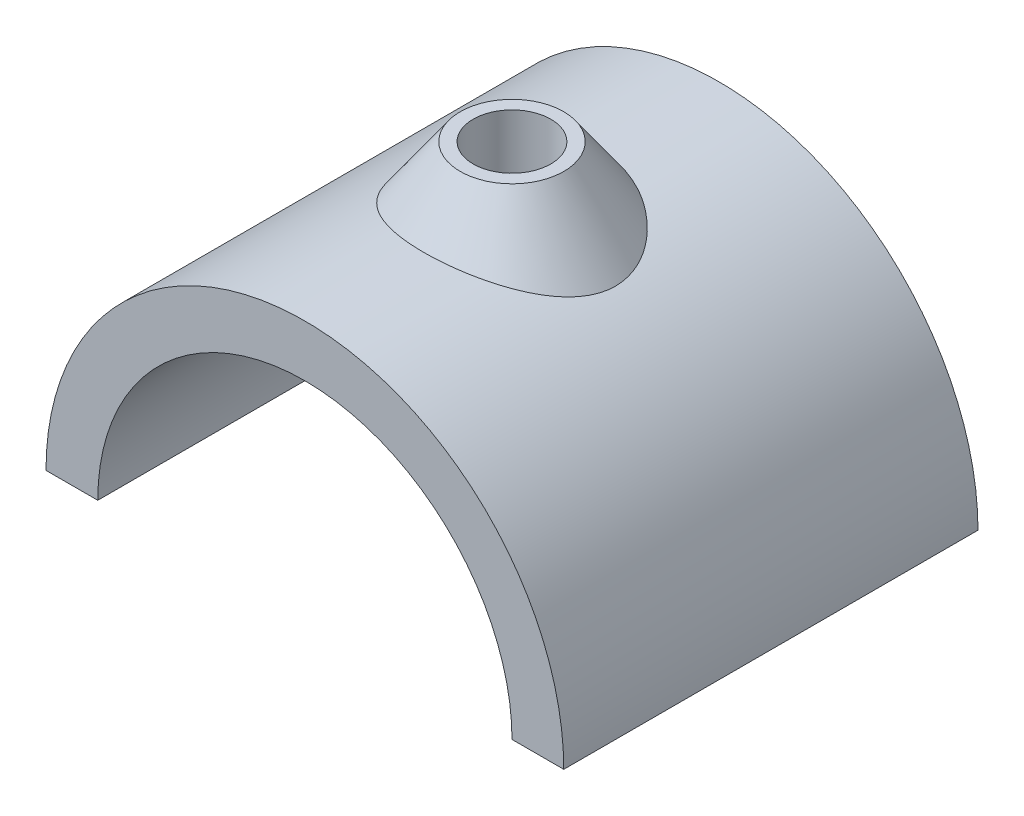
ISO-10303-21;
HEADER;
FILE_DESCRIPTION(('STEP AP214'),'2;1');
FILE_NAME('part.step','',(''),(''),'','','');
FILE_SCHEMA(('AUTOMOTIVE_DESIGN { 1 0 10303 214 1 1 1 1 }'));
ENDSEC;
DATA;
#1=APPLICATION_CONTEXT('core data for automotive mechanical design processes');
#2=APPLICATION_PROTOCOL_DEFINITION('international standard','automotive_design',2000,#1);
#3=PRODUCT_CONTEXT('',#1,'mechanical');
#4=PRODUCT('Part','Part','',(#3));
#5=PRODUCT_RELATED_PRODUCT_CATEGORY('part','',(#4));
#6=PRODUCT_DEFINITION_FORMATION('','',#4);
#7=PRODUCT_DEFINITION_CONTEXT('part definition',#1,'design');
#8=PRODUCT_DEFINITION('design','',#6,#7);
#9=PRODUCT_DEFINITION_SHAPE('','',#8);
#10=(LENGTH_UNIT() NAMED_UNIT(*) SI_UNIT(.MILLI.,.METRE.));
#11=(NAMED_UNIT(*) PLANE_ANGLE_UNIT() SI_UNIT($,.RADIAN.));
#12=(NAMED_UNIT(*) SI_UNIT($,.STERADIAN.) SOLID_ANGLE_UNIT());
#13=UNCERTAINTY_MEASURE_WITH_UNIT(LENGTH_MEASURE(1.E-05),#10,'distance_accuracy_value','');
#14=(GEOMETRIC_REPRESENTATION_CONTEXT(3) GLOBAL_UNCERTAINTY_ASSIGNED_CONTEXT((#13)) GLOBAL_UNIT_ASSIGNED_CONTEXT((#10,
#11,#12)) REPRESENTATION_CONTEXT('',''));
#15=CARTESIAN_POINT('',(0.,0.,0.));
#16=DIRECTION('',(0.,0.,1.));
#17=DIRECTION('',(1.,0.,0.));
#18=AXIS2_PLACEMENT_3D('',#15,#16,#17);
#19=CARTESIAN_POINT('',(0.,0.,40.));
#20=DIRECTION('',(0.,0.,-1.));
#21=DIRECTION('',(-1.,0.,0.));
#22=AXIS2_PLACEMENT_3D('',#19,#20,#21);
#23=CYLINDRICAL_SURFACE('',#22,50.);
#24=CARTESIAN_POINT('',(0.,0.,-40.));
#25=DIRECTION('',(0.,0.,1.));
#26=DIRECTION('',(-1.,0.,0.));
#27=AXIS2_PLACEMENT_3D('',#24,#25,#26);
#28=CIRCLE('',#27,50.);
#29=CARTESIAN_POINT('',(50.,0.,-40.));
#30=VERTEX_POINT('',#29);
#31=CARTESIAN_POINT('',(-50.,0.,-40.));
#32=VERTEX_POINT('',#31);
#33=EDGE_CURVE('E101',#30,#32,#28,.T.);
#34=ORIENTED_EDGE('',*,*,#33,.T.);
#35=DIRECTION('',(0.,0.,-1.));
#36=VECTOR('',#35,1.);
#37=CARTESIAN_POINT('',(-50.,0.,40.));
#38=LINE('',#37,#36);
#39=CARTESIAN_POINT('',(-50.,0.,40.));
#40=VERTEX_POINT('',#39);
#41=EDGE_CURVE('E43',#40,#32,#38,.T.);
#42=ORIENTED_EDGE('',*,*,#41,.F.);
#43=CARTESIAN_POINT('',(0.,0.,40.));
#44=DIRECTION('',(0.,0.,1.));
#45=DIRECTION('',(-1.,0.,0.));
#46=AXIS2_PLACEMENT_3D('',#43,#44,#45);
#47=CIRCLE('',#46,50.);
#48=CARTESIAN_POINT('',(50.,0.,40.));
#49=VERTEX_POINT('',#48);
#50=EDGE_CURVE('E87',#49,#40,#47,.T.);
#51=ORIENTED_EDGE('',*,*,#50,.F.);
#52=DIRECTION('',(0.,0.,-1.));
#53=VECTOR('',#52,1.);
#54=CARTESIAN_POINT('',(50.,0.,40.));
#55=LINE('',#54,#53);
#56=EDGE_CURVE('E97',#49,#30,#55,.T.);
#57=ORIENTED_EDGE('',*,*,#56,.T.);
#58=EDGE_LOOP('',(#34,#42,#51,#57));
#59=FACE_BOUND('',#58,.T.);
#60=CARTESIAN_POINT('',(-13.3891413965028,48.1739648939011,-12.5382835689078));
#61=CARTESIAN_POINT('',(-13.7678496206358,48.0687121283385,-12.2425151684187));
#62=CARTESIAN_POINT('',(-14.1355399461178,47.9616998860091,-11.9333646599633));
#63=CARTESIAN_POINT('',(-14.8468065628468,47.7463122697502,-11.2886841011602));
#64=CARTESIAN_POINT('',(-15.1903786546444,47.6379366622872,-10.9531494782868));
#65=CARTESIAN_POINT('',(-15.8509248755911,47.4222415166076,-10.2561478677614));
#66=CARTESIAN_POINT('',(-16.1678850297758,47.3149225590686,-9.89466743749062));
#67=CARTESIAN_POINT('',(-16.7720702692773,47.1041398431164,-9.14660673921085));
#68=CARTESIAN_POINT('',(-17.0593004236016,47.0006754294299,-8.76003076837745));
#69=CARTESIAN_POINT('',(-17.5616027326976,46.8150736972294,-8.020280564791));
#70=CARTESIAN_POINT('',(-17.7811052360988,46.7320142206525,-7.6703446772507));
#71=CARTESIAN_POINT('',(-18.1935552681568,46.5729899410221,-6.95364153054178));
#72=CARTESIAN_POINT('',(-18.3865080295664,46.497023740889,-6.58687760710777));
#73=CARTESIAN_POINT('',(-18.7432827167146,46.3543555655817,-5.83786916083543));
#74=CARTESIAN_POINT('',(-18.9071182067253,46.2876492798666,-5.45563194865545));
#75=CARTESIAN_POINT('',(-19.2030720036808,46.1656546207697,-4.67748355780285));
#76=CARTESIAN_POINT('',(-19.3352073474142,46.1103601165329,-4.28157985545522));
#77=CARTESIAN_POINT('',(-19.5664669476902,46.0127083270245,-3.47443087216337));
#78=CARTESIAN_POINT('',(-19.6652603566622,45.9704810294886,-3.06307441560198));
#79=CARTESIAN_POINT('',(-19.8258361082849,45.9014586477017,-2.23188204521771));
#80=CARTESIAN_POINT('',(-19.8876188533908,45.8746633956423,-1.81204622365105));
#81=CARTESIAN_POINT('',(-19.9725953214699,45.8377312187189,-0.968068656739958));
#82=CARTESIAN_POINT('',(-19.9958190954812,45.8275813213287,-0.543930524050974));
#83=CARTESIAN_POINT('',(-20.0031474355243,45.8243836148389,0.304723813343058));
#84=CARTESIAN_POINT('',(-19.9872564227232,45.8313338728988,0.729239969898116));
#85=CARTESIAN_POINT('',(-19.9217501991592,45.8598393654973,1.51510585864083));
#86=CARTESIAN_POINT('',(-19.8771744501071,45.8792108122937,1.87696871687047));
#87=CARTESIAN_POINT('',(-19.7602683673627,45.9296837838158,2.59548308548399));
#88=CARTESIAN_POINT('',(-19.6879277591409,45.9607896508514,2.95213261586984));
#89=CARTESIAN_POINT('',(-19.5167211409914,46.0337509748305,3.65797367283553));
#90=CARTESIAN_POINT('',(-19.417846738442,46.0756098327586,4.0071628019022));
#91=CARTESIAN_POINT('',(-19.1951137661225,46.1688440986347,4.69619860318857));
#92=CARTESIAN_POINT('',(-19.0712503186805,46.2202213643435,5.03604343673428));
#93=CARTESIAN_POINT('',(-18.7634966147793,46.346152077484,5.79552561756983));
#94=CARTESIAN_POINT('',(-18.5724341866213,46.4232141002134,6.21185120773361));
#95=CARTESIAN_POINT('',(-18.1561339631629,46.5876039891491,7.02492625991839));
#96=CARTESIAN_POINT('',(-17.9308876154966,46.6749344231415,7.42167079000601));
#97=CARTESIAN_POINT('',(-17.4493029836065,46.8571034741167,8.1944991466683));
#98=CARTESIAN_POINT('',(-17.1929341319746,46.9519494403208,8.57056212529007));
#99=CARTESIAN_POINT('',(-16.6522854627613,47.1464092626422,9.3006488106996));
#100=CARTESIAN_POINT('',(-16.3680069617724,47.2460228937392,9.6546735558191));
#101=CARTESIAN_POINT('',(-15.7698163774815,47.4490684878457,10.3450848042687));
#102=CARTESIAN_POINT('',(-15.4555317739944,47.5525349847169,10.6811377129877));
#103=CARTESIAN_POINT('',(-14.8033495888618,47.7595843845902,11.3293994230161));
#104=CARTESIAN_POINT('',(-14.4654521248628,47.8631672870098,11.6416083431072));
#105=CARTESIAN_POINT('',(-13.768225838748,48.0683678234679,12.241673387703));
#106=CARTESIAN_POINT('',(-13.4088999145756,48.1699857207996,12.5295327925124));
#107=CARTESIAN_POINT('',(-12.6707051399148,48.3694062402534,13.0804654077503));
#108=CARTESIAN_POINT('',(-12.2918346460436,48.4672085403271,13.3435365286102));
#109=CARTESIAN_POINT('',(-11.4340767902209,48.677468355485,13.8974857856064));
#110=CARTESIAN_POINT('',(-10.9510211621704,48.788633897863,14.1824253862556));
#111=CARTESIAN_POINT('',(-9.96197434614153,49.0001518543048,14.7140163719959));
#112=CARTESIAN_POINT('',(-9.45598055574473,49.1005030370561,14.9606633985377));
#113=CARTESIAN_POINT('',(-8.42400419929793,49.2880437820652,15.414596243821));
#114=CARTESIAN_POINT('',(-7.89801333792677,49.3752278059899,15.6218655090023));
#115=CARTESIAN_POINT('',(-6.82953264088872,49.5343237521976,15.9957431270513));
#116=CARTESIAN_POINT('',(-6.2870429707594,49.606235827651,16.162351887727));
#117=CARTESIAN_POINT('',(-5.16464875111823,49.7358969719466,16.4602894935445));
#118=CARTESIAN_POINT('',(-4.58415159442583,49.7928770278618,16.589727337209));
#119=CARTESIAN_POINT('',(-3.41308071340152,49.8868314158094,16.8020359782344));
#120=CARTESIAN_POINT('',(-2.82250661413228,49.9238050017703,16.8849050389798));
#121=CARTESIAN_POINT('',(-1.63581969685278,49.9767621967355,17.0033363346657));
#122=CARTESIAN_POINT('',(-1.03970808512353,49.9927502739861,17.0389086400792));
#123=CARTESIAN_POINT('',(0.153630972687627,50.0033239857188,17.062452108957));
#124=CARTESIAN_POINT('',(0.750858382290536,49.9979103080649,17.0504248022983));
#125=CARTESIAN_POINT('',(1.92447799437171,49.9662976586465,16.9799316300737));
#126=CARTESIAN_POINT('',(2.50096941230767,49.9407101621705,16.9228318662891));
#127=CARTESIAN_POINT('',(3.64662073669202,49.8701466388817,16.7643664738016));
#128=CARTESIAN_POINT('',(4.21578076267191,49.8251709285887,16.6630015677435));
#129=CARTESIAN_POINT('',(5.34282720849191,49.7169458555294,16.4168130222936));
#130=CARTESIAN_POINT('',(5.90071385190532,49.6536968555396,16.2719902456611));
#131=CARTESIAN_POINT('',(7.00151077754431,49.5104730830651,15.9399261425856));
#132=CARTESIAN_POINT('',(7.54442079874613,49.4304980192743,15.752684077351));
#133=CARTESIAN_POINT('',(8.61615087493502,49.255042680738,15.3352468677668));
#134=CARTESIAN_POINT('',(9.14481786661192,49.1594400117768,15.1047103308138));
#135=CARTESIAN_POINT('',(10.1799423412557,48.9555621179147,14.6029582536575));
#136=CARTESIAN_POINT('',(10.6863994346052,48.8472866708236,14.3317420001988));
#137=CARTESIAN_POINT('',(11.6743902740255,48.6206315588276,13.7494547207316));
#138=CARTESIAN_POINT('',(12.1558917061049,48.5022392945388,13.4383337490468));
#139=CARTESIAN_POINT('',(13.0898770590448,48.2585542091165,12.7775900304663));
#140=CARTESIAN_POINT('',(13.5423610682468,48.1332614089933,12.4279674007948));
#141=CARTESIAN_POINT('',(14.4249796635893,47.8762587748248,11.6824770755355));
#142=CARTESIAN_POINT('',(14.8543352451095,47.7444672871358,11.2857130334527));
#143=CARTESIAN_POINT('',(15.6745270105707,47.4815195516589,10.4537302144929));
#144=CARTESIAN_POINT('',(16.0653561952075,47.3503634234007,10.0185044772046));
#145=CARTESIAN_POINT('',(16.8024518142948,47.0938380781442,9.11180361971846));
#146=CARTESIAN_POINT('',(17.148814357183,46.9684567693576,8.64041032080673));
#147=CARTESIAN_POINT('',(17.7918161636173,46.7286741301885,7.66234086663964));
#148=CARTESIAN_POINT('',(18.0884859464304,46.61426607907,7.15568663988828));
#149=CARTESIAN_POINT('',(18.5323574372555,46.4390719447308,6.29098533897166));
#150=CARTESIAN_POINT('',(18.6957603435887,46.3734285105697,5.94216987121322));
#151=CARTESIAN_POINT('',(18.9963113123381,46.2511240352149,5.23192070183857));
#152=CARTESIAN_POINT('',(19.1334670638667,46.1944603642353,4.87049073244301));
#153=CARTESIAN_POINT('',(19.3793590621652,46.091845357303,4.13699980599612));
#154=CARTESIAN_POINT('',(19.4881248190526,46.0458829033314,3.76495033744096));
#155=CARTESIAN_POINT('',(19.6755242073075,45.9661195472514,3.01200749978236));
#156=CARTESIAN_POINT('',(19.7541570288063,45.9323189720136,2.631113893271));
#157=CARTESIAN_POINT('',(19.8801040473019,45.8779492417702,1.86085016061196));
#158=CARTESIAN_POINT('',(19.9272266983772,45.8574610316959,1.47144279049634));
#159=CARTESIAN_POINT('',(19.98836125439,45.8308470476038,0.689537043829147));
#160=CARTESIAN_POINT('',(20.0023735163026,45.8247211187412,0.297038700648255));
#161=CARTESIAN_POINT('',(19.9969700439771,45.8270792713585,-0.487682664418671));
#162=CARTESIAN_POINT('',(19.9775540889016,45.8355634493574,-0.879905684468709));
#163=CARTESIAN_POINT('',(19.9057320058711,45.8668001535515,-1.6607240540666));
#164=CARTESIAN_POINT('',(19.8533268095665,45.889552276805,-2.04931950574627));
#165=CARTESIAN_POINT('',(19.7224118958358,45.9459580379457,-2.78741423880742));
#166=CARTESIAN_POINT('',(19.6464643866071,45.9785355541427,-3.13745592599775));
#167=CARTESIAN_POINT('',(19.4690781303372,46.0539279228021,-3.83001266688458));
#168=CARTESIAN_POINT('',(19.3676297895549,46.0967466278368,-4.17252483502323));
#169=CARTESIAN_POINT('',(19.1407265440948,46.1914242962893,-4.84828787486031));
#170=CARTESIAN_POINT('',(19.0152655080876,46.2432855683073,-5.18153635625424));
#171=CARTESIAN_POINT('',(18.7419553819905,46.3547288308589,-5.83741572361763));
#172=CARTESIAN_POINT('',(18.5941017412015,46.4143123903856,-6.16004443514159));
#173=CARTESIAN_POINT('',(18.2191914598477,46.5630255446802,-6.91065246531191));
#174=CARTESIAN_POINT('',(17.9830442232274,46.6549430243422,-7.33356157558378));
#175=CARTESIAN_POINT('',(17.4757628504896,46.8473189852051,-8.1558191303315));
#176=CARTESIAN_POINT('',(17.2046176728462,46.9477801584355,-8.55516008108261));
#177=CARTESIAN_POINT('',(16.6306102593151,47.1541717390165,-9.32953667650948));
#178=CARTESIAN_POINT('',(16.3277114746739,47.2601083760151,-9.70454349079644));
#179=CARTESIAN_POINT('',(15.6936257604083,47.4744363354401,-10.4289482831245));
#180=CARTESIAN_POINT('',(15.3624408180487,47.5828274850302,-10.7783480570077));
#181=CARTESIAN_POINT('',(14.6693387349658,47.8010927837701,-11.4560319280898));
#182=CARTESIAN_POINT('',(14.3070354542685,47.9109648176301,-11.7839211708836));
#183=CARTESIAN_POINT('',(13.5586113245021,48.128119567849,-12.4121799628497));
#184=CARTESIAN_POINT('',(13.1724904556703,48.2354022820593,-12.7125494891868));
#185=CARTESIAN_POINT('',(12.3787954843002,48.4451634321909,-13.2851144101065));
#186=CARTESIAN_POINT('',(11.9712258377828,48.5476428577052,-13.5573156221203));
#187=CARTESIAN_POINT('',(11.1367025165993,48.7458494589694,-14.0729584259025));
#188=CARTESIAN_POINT('',(10.7097476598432,48.8415762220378,-14.3163982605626));
#189=CARTESIAN_POINT('',(9.76304316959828,49.0403461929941,-14.8134205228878));
#190=CARTESIAN_POINT('',(9.24003048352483,49.1417844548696,-15.0614553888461));
#191=CARTESIAN_POINT('',(8.17360425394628,49.3303706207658,-15.5156748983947));
#192=CARTESIAN_POINT('',(7.63018869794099,49.4175171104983,-15.7218554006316));
#193=CARTESIAN_POINT('',(6.526459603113,49.5753579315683,-16.0911257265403));
#194=CARTESIAN_POINT('',(5.96614317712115,49.6460494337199,-16.2542081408));
#195=CARTESIAN_POINT('',(4.83252111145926,49.7691850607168,-16.5360743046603));
#196=CARTESIAN_POINT('',(4.25921587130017,49.8216297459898,-16.6548594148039));
#197=CARTESIAN_POINT('',(3.09852266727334,49.9073214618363,-16.848047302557));
#198=CARTESIAN_POINT('',(2.51105512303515,49.940395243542,-16.9220497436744));
#199=CARTESIAN_POINT('',(1.33129523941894,49.9857592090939,-17.0233800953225));
#200=CARTESIAN_POINT('',(0.739002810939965,49.998049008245,-17.0507071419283));
#201=CARTESIAN_POINT('',(-0.44604054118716,50.0015218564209,-17.0584384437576));
#202=CARTESIAN_POINT('',(-1.0387915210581,49.9927016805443,-17.0388355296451));
#203=CARTESIAN_POINT('',(-2.22018689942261,49.9541795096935,-16.9528699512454));
#204=CARTESIAN_POINT('',(-2.80883144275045,49.9244782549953,-16.8865089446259));
#205=CARTESIAN_POINT('',(-3.96285675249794,49.8459805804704,-16.7098810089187));
#206=CARTESIAN_POINT('',(-4.52844911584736,49.7976868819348,-16.6007687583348));
#207=CARTESIAN_POINT('',(-5.64778300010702,49.6831871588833,-16.3395226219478));
#208=CARTESIAN_POINT('',(-6.20152385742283,49.6169801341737,-16.1873863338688));
#209=CARTESIAN_POINT('',(-7.29292963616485,49.4683352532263,-15.8413294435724));
#210=CARTESIAN_POINT('',(-7.83061002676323,49.3859136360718,-15.6474506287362));
#211=CARTESIAN_POINT('',(-8.88687930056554,49.2068120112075,-15.219067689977));
#212=CARTESIAN_POINT('',(-9.40547294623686,49.1101355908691,-14.9845737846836));
#213=CARTESIAN_POINT('',(-10.52884137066,48.882901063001,-14.4218181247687));
#214=CARTESIAN_POINT('',(-11.1283955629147,48.749514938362,-14.0842248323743));
#215=CARTESIAN_POINT('',(-12.2891161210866,48.4699283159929,-13.3528803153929));
#216=CARTESIAN_POINT('',(-12.8502822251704,48.3237277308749,-12.9591287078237));
#217=CARTESIAN_POINT('',(-13.3891413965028,48.1739648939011,-12.5382835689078));
#218=B_SPLINE_CURVE_WITH_KNOTS('',3,(#60,#61,#62,#63,#64,#65,#66,#67,#68,#69,#70,#71,#72,#73,
#74,#75,#76,#77,#78,#79,#80,#81,#82,#83,#84,#85,#86,#87,#88,#89,#90,#91,#92,#93,#94,#95,#96,#97,
#98,#99,#100,#101,#102,#103,#104,#105,#106,#107,#108,#109,#110,#111,#112,#113,#114,#115,#116,
#117,#118,#119,#120,#121,#122,#123,#124,#125,#126,#127,#128,#129,#130,#131,#132,#133,#134,#135,
#136,#137,#138,#139,#140,#141,#142,#143,#144,#145,#146,#147,#148,#149,#150,#151,#152,#153,#154,
#155,#156,#157,#158,#159,#160,#161,#162,#163,#164,#165,#166,#167,#168,#169,#170,#171,#172,#173,
#174,#175,#176,#177,#178,#179,#180,#181,#182,#183,#184,#185,#186,#187,#188,#189,#190,#191,#192,
#193,#194,#195,#196,#197,#198,#199,#200,#201,#202,#203,#204,#205,#206,#207,#208,#209,#210,#211,
#212,#213,#214,#215,#216,#217),.UNSPECIFIED.,.T.,.F.,(4,2,2,2,2,2,2,2,2,2,2,2,2,2,2,2,2,2,2,2,2,
2,2,2,2,2,2,2,2,2,2,2,2,2,2,2,2,2,2,2,2,2,2,2,2,2,2,2,2,2,2,2,2,2,2,2,2,2,2,2,2,2,2,2,2,2,2,2,2,
2,2,2,2,2,2,2,2,2,4),(0.,1.47530725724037,2.95087076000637,4.42720435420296,5.90328581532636,
7.16620373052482,8.4288723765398,9.69095125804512,10.9523503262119,12.2259213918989,
13.4994786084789,14.7720428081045,16.044463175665,17.1385243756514,18.2329908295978,
19.3278038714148,20.4228308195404,21.8143684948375,23.2062548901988,24.5995195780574,
25.9927185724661,27.4062887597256,28.8198519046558,30.2332243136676,31.6467157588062,
33.3600387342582,35.0735565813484,36.7877931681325,38.5020125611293,40.2922106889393,
42.082475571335,43.8723592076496,45.662185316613,47.3997545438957,49.1372954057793,
50.8748017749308,52.6123384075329,54.36419986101,56.1160920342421,57.8701987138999,
59.624300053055,61.4197798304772,63.2155852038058,65.0074413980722,66.7981930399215,
67.9693883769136,69.1402400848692,70.3098698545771,71.4795310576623,72.6562393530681,
73.8329349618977,75.0096383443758,76.1863084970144,77.2641499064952,78.3423974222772,
79.4209206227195,80.4996632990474,81.9765849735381,83.453973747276,84.9330820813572,
86.412086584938,87.9132529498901,89.4144205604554,90.9152775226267,92.4162261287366,
94.177169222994,95.938286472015,97.6997062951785,99.461072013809,101.237959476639,
103.014879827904,104.792071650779,106.569200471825,108.301315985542,110.033528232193,
111.764014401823,113.494065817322,115.593247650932,117.692443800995),.UNSPECIFIED.);
#219=CARTESIAN_POINT('',(-13.3891413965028,48.1739648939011,-12.5382835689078));
#220=VERTEX_POINT('',#219);
#221=EDGE_CURVE('E11',#220,#220,#218,.T.);
#222=ORIENTED_EDGE('',*,*,#221,.F.);
#223=EDGE_LOOP('',(#222));
#224=FACE_BOUND('',#223,.T.);
#225=ADVANCED_FACE('F31',(#59,#224),#23,.T.);
#226=CARTESIAN_POINT('',(-40.,0.,40.));
#227=DIRECTION('',(0.,1.,0.));
#228=DIRECTION('',(0.,0.,1.));
#229=AXIS2_PLACEMENT_3D('',#226,#227,#228);
#230=PLANE('',#229);
#231=DIRECTION('',(1.,0.,0.));
#232=VECTOR('',#231,1.);
#233=CARTESIAN_POINT('',(-40.,0.,-40.));
#234=LINE('',#233,#232);
#235=CARTESIAN_POINT('',(-40.,0.,-40.));
#236=VERTEX_POINT('',#235);
#237=EDGE_CURVE('E92',#32,#236,#234,.T.);
#238=ORIENTED_EDGE('',*,*,#237,.T.);
#239=DIRECTION('',(0.,0.,-1.));
#240=VECTOR('',#239,1.);
#241=CARTESIAN_POINT('',(-40.,0.,40.));
#242=LINE('',#241,#240);
#243=CARTESIAN_POINT('',(-40.,0.,40.));
#244=VERTEX_POINT('',#243);
#245=EDGE_CURVE('E90',#244,#236,#242,.T.);
#246=ORIENTED_EDGE('',*,*,#245,.F.);
#247=DIRECTION('',(1.,0.,0.));
#248=VECTOR('',#247,1.);
#249=CARTESIAN_POINT('',(-40.,0.,40.));
#250=LINE('',#249,#248);
#251=EDGE_CURVE('E82',#40,#244,#250,.T.);
#252=ORIENTED_EDGE('',*,*,#251,.F.);
#253=ORIENTED_EDGE('',*,*,#41,.T.);
#254=EDGE_LOOP('',(#238,#246,#252,#253));
#255=FACE_BOUND('',#254,.T.);
#256=ADVANCED_FACE('F91',(#255),#230,.F.);
#257=CARTESIAN_POINT('',(0.,0.,40.));
#258=DIRECTION('',(0.,0.,-1.));
#259=DIRECTION('',(-1.,0.,0.));
#260=AXIS2_PLACEMENT_3D('',#257,#258,#259);
#261=CYLINDRICAL_SURFACE('',#260,40.);
#262=CARTESIAN_POINT('',(0.,40.,7.5));
#263=CARTESIAN_POINT('',(0.208750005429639,40.0000018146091,7.50000377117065));
#264=CARTESIAN_POINT('',(0.417451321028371,39.9983629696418,7.49128225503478));
#265=CARTESIAN_POINT('',(0.833413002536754,39.9918572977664,7.45647137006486));
#266=CARTESIAN_POINT('',(1.04067310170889,39.9869898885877,7.43037886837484));
#267=CARTESIAN_POINT('',(1.45231077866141,39.9741571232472,7.36100481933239));
#268=CARTESIAN_POINT('',(1.65668666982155,39.9661900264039,7.31771361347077));
#269=CARTESIAN_POINT('',(2.06106821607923,39.9473776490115,7.2142614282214));
#270=CARTESIAN_POINT('',(2.26107223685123,39.9365313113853,7.15409425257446));
#271=CARTESIAN_POINT('',(2.65497439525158,39.9122788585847,7.01744361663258));
#272=CARTESIAN_POINT('',(2.84888005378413,39.8988760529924,6.94098123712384));
#273=CARTESIAN_POINT('',(3.22959116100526,39.8698658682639,6.77223092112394));
#274=CARTESIAN_POINT('',(3.41639396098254,39.8542576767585,6.67993715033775));
#275=CARTESIAN_POINT('',(3.78147202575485,39.8212763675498,6.48025757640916));
#276=CARTESIAN_POINT('',(3.95975122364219,39.8039040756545,6.37287882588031));
#277=CARTESIAN_POINT('',(4.30674780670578,39.7678559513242,6.14370991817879));
#278=CARTESIAN_POINT('',(4.47546159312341,39.7491796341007,6.0219143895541));
#279=CARTESIAN_POINT('',(4.80383014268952,39.7108401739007,5.76344727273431));
#280=CARTESIAN_POINT('',(4.96337292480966,39.6911688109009,5.6266346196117));
#281=CARTESIAN_POINT('',(5.27045902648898,39.6515604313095,5.34007334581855));
#282=CARTESIAN_POINT('',(5.41799787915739,39.6316233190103,5.19031995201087));
#283=CARTESIAN_POINT('',(5.69996538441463,39.5920530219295,4.87898453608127));
#284=CARTESIAN_POINT('',(5.83439788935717,39.5724197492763,4.71740601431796));
#285=CARTESIAN_POINT('',(6.08932223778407,39.5339952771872,4.38341253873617));
#286=CARTESIAN_POINT('',(6.20980892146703,39.5152043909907,4.2109936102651));
#287=CARTESIAN_POINT('',(6.43681359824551,39.4788646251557,3.85516665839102));
#288=CARTESIAN_POINT('',(6.54321610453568,39.461326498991,3.67168382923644));
#289=CARTESIAN_POINT('',(6.74016524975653,39.4281644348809,3.29622689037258));
#290=CARTESIAN_POINT('',(6.83071170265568,39.4125405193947,3.10425268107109));
#291=CARTESIAN_POINT('',(6.99525813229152,39.3836685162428,2.71318301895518));
#292=CARTESIAN_POINT('',(7.06925945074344,39.370420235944,2.51408814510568));
#293=CARTESIAN_POINT('',(7.20015170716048,39.3466929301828,2.11018533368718));
#294=CARTESIAN_POINT('',(7.25704246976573,39.3362139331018,1.90537733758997));
#295=CARTESIAN_POINT('',(7.352702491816,39.3184448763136,1.49393997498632));
#296=CARTESIAN_POINT('',(7.39167387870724,39.3111193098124,1.28735912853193));
#297=CARTESIAN_POINT('',(7.4521472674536,39.2997003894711,0.871569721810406));
#298=CARTESIAN_POINT('',(7.47364958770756,39.2956069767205,0.662361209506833));
#299=CARTESIAN_POINT('',(7.49901166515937,39.2907748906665,0.242854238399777));
#300=CARTESIAN_POINT('',(7.50287272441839,39.2900359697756,0.0325558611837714));
#301=CARTESIAN_POINT('',(7.49292465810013,39.2919343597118,-0.387606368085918));
#302=CARTESIAN_POINT('',(7.47911563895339,39.2945716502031,-0.597470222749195));
#303=CARTESIAN_POINT('',(7.43424108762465,39.3030860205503,-1.01243631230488));
#304=CARTESIAN_POINT('',(7.40340869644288,39.3089193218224,-1.21756469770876));
#305=CARTESIAN_POINT('',(7.32488121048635,39.323627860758,-1.62452545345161));
#306=CARTESIAN_POINT('',(7.27718035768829,39.3325041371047,-1.82635667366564));
#307=CARTESIAN_POINT('',(7.16529025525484,39.3530411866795,-2.22519150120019));
#308=CARTESIAN_POINT('',(7.10110642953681,39.3647010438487,-2.4221966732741));
#309=CARTESIAN_POINT('',(6.95673659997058,39.3904705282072,-2.81011155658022));
#310=CARTESIAN_POINT('',(6.8765446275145,39.4045810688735,-3.0010189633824));
#311=CARTESIAN_POINT('',(6.61176464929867,39.4501830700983,-3.56471307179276));
#312=CARTESIAN_POINT('',(6.40353274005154,39.4848365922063,-3.92648060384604));
#313=CARTESIAN_POINT('',(5.93044638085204,39.5586511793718,-4.61008539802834));
#314=CARTESIAN_POINT('',(5.66558618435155,39.5978127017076,-4.93191860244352));
#315=CARTESIAN_POINT('',(5.0817013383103,39.6769993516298,-5.53210785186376));
#316=CARTESIAN_POINT('',(4.76188882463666,39.7170283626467,-5.80969873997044));
#317=CARTESIAN_POINT('',(4.07983854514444,39.7928694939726,-6.30739072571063));
#318=CARTESIAN_POINT('',(3.71760035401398,39.8286815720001,-6.52749124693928));
#319=CARTESIAN_POINT('',(2.96017545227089,39.8921269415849,-6.90408760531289));
#320=CARTESIAN_POINT('',(2.56494821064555,39.9197499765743,-7.06050377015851));
#321=CARTESIAN_POINT('',(1.75319518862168,39.9636252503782,-7.30451059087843));
#322=CARTESIAN_POINT('',(1.33667167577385,39.9798786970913,-7.39210855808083));
#323=CARTESIAN_POINT('',(0.500744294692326,39.9990181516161,-7.49493080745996));
#324=CARTESIAN_POINT('',(0.0814737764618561,40.0020980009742,-7.51120466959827));
#325=CARTESIAN_POINT('',(-0.753809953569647,39.9950767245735,-7.47371989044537));
#326=CARTESIAN_POINT('',(-1.16982332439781,39.98497624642,-7.41996468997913));
#327=CARTESIAN_POINT('',(-1.98339415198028,39.9528572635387,-7.24486493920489));
#328=CARTESIAN_POINT('',(-2.38107031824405,39.9309323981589,-7.12405122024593));
#329=CARTESIAN_POINT('',(-3.15069414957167,39.8775858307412,-6.81867383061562));
#330=CARTESIAN_POINT('',(-3.52264006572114,39.8461634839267,-6.63410583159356));
#331=CARTESIAN_POINT('',(-4.05529880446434,39.7943106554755,-6.31256049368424));
#332=CARTESIAN_POINT('',(-4.2295913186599,39.7761185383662,-6.19711569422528));
#333=CARTESIAN_POINT('',(-4.56785316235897,39.7386912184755,-5.95216291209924));
#334=CARTESIAN_POINT('',(-4.73182609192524,39.7194563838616,-5.82265987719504));
#335=CARTESIAN_POINT('',(-5.04842258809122,39.6804600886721,-5.55041076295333));
#336=CARTESIAN_POINT('',(-5.20104108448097,39.6606983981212,-5.40765883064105));
#337=CARTESIAN_POINT('',(-5.4937909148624,39.621207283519,-5.10997248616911));
#338=CARTESIAN_POINT('',(-5.63392671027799,39.6014778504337,-4.95504246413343));
#339=CARTESIAN_POINT('',(-5.90264796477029,39.5623235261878,-4.63179501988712));
#340=CARTESIAN_POINT('',(-6.03104923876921,39.542906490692,-4.46332348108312));
#341=CARTESIAN_POINT('',(-6.27315502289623,39.5052216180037,-4.11610292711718));
#342=CARTESIAN_POINT('',(-6.38686493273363,39.4869533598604,-3.93735772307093));
#343=CARTESIAN_POINT('',(-6.59886017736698,39.4520797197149,-3.57070083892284));
#344=CARTESIAN_POINT('',(-6.69714001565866,39.4354749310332,-3.38278592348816));
#345=CARTESIAN_POINT('',(-6.87746127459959,39.4044274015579,-2.9992356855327));
#346=CARTESIAN_POINT('',(-6.95950899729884,39.3899838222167,-2.80360339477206));
#347=CARTESIAN_POINT('',(-7.10645568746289,39.3637375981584,-2.40683213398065));
#348=CARTESIAN_POINT('',(-7.1714301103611,39.3519233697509,-2.20572188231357));
#349=CARTESIAN_POINT('',(-7.28418636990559,39.33120793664,-1.79866972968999));
#350=CARTESIAN_POINT('',(-7.3319745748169,39.3223056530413,-1.59272964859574));
#351=CARTESIAN_POINT('',(-7.41001514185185,39.3076742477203,-1.17742182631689));
#352=CARTESIAN_POINT('',(-7.4402659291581,39.3019454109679,-0.968053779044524));
#353=CARTESIAN_POINT('',(-7.48297956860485,39.2938352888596,-0.547447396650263));
#354=CARTESIAN_POINT('',(-7.49544263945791,39.2914539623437,-0.336209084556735));
#355=CARTESIAN_POINT('',(-7.50242336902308,39.2901215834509,0.0831741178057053));
#356=CARTESIAN_POINT('',(-7.49722631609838,39.2911159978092,0.291314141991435));
#357=CARTESIAN_POINT('',(-7.46955090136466,39.2963866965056,0.706473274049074));
#358=CARTESIAN_POINT('',(-7.44706654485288,39.3006641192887,0.913491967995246));
#359=CARTESIAN_POINT('',(-7.38499291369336,39.3123755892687,1.32481369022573));
#360=CARTESIAN_POINT('',(-7.34540711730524,39.3198089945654,1.5291172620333));
#361=CARTESIAN_POINT('',(-7.2494375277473,39.3376160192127,1.93361428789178));
#362=CARTESIAN_POINT('',(-7.19305323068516,39.3479897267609,2.13380761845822));
#363=CARTESIAN_POINT('',(-7.06403915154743,39.3713555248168,2.52830745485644));
#364=CARTESIAN_POINT('',(-6.99144041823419,39.384342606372,2.72262441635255));
#365=CARTESIAN_POINT('',(-6.83047400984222,39.4125779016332,3.1044401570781));
#366=CARTESIAN_POINT('',(-6.74210638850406,39.4278261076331,3.29193895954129));
#367=CARTESIAN_POINT('',(-6.55023148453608,39.4601562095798,3.65887062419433));
#368=CARTESIAN_POINT('',(-6.4467232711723,39.4772382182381,3.8383029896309));
#369=CARTESIAN_POINT('',(-6.22529681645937,39.512760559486,4.18789828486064));
#370=CARTESIAN_POINT('',(-6.10737866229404,39.531200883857,4.35806127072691));
#371=CARTESIAN_POINT('',(-5.85604152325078,39.5692199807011,4.69050697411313));
#372=CARTESIAN_POINT('',(-5.72241450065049,39.5888117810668,4.85263095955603));
#373=CARTESIAN_POINT('',(-5.44210850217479,39.6283165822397,5.16502476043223));
#374=CARTESIAN_POINT('',(-5.29543414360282,39.6482294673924,5.31529873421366));
#375=CARTESIAN_POINT('',(-4.98989811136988,39.6878401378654,5.60312333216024));
#376=CARTESIAN_POINT('',(-4.8310292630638,39.7075377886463,5.74066635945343));
#377=CARTESIAN_POINT('',(-4.50231607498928,39.7461510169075,6.00193406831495));
#378=CARTESIAN_POINT('',(-4.33247580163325,39.7650668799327,6.12566382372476));
#379=CARTESIAN_POINT('',(-3.98126969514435,39.801770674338,6.35959306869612));
#380=CARTESIAN_POINT('',(-3.79981050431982,39.8195463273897,6.46965439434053));
#381=CARTESIAN_POINT('',(-3.42815726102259,39.8532625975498,6.67403161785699));
#382=CARTESIAN_POINT('',(-3.23796645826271,39.8692038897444,6.76835331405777));
#383=CARTESIAN_POINT('',(-2.85024127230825,39.8987955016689,6.94053893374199));
#384=CARTESIAN_POINT('',(-2.6527116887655,39.9124472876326,7.01841339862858));
#385=CARTESIAN_POINT('',(-2.25167735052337,39.9370797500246,7.15716306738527));
#386=CARTESIAN_POINT('',(-2.04817380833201,39.9480609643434,7.21804169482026));
#387=CARTESIAN_POINT('',(-1.54187254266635,39.9714011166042,7.34633429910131));
#388=CARTESIAN_POINT('',(-1.23643982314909,39.9820722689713,7.40388445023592));
#389=CARTESIAN_POINT('',(-0.620635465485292,39.9963702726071,7.4807140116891));
#390=CARTESIAN_POINT('',(-0.310263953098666,39.9999973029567,7.49999439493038));
#391=CARTESIAN_POINT('',(0.,40.,7.5));
#392=B_SPLINE_CURVE_WITH_KNOTS('',3,(#262,#263,#264,#265,#266,#267,#268,#269,#270,#271,#272,
#273,#274,#275,#276,#277,#278,#279,#280,#281,#282,#283,#284,#285,#286,#287,#288,#289,#290,#291,
#292,#293,#294,#295,#296,#297,#298,#299,#300,#301,#302,#303,#304,#305,#306,#307,#308,#309,#310,
#311,#312,#313,#314,#315,#316,#317,#318,#319,#320,#321,#322,#323,#324,#325,#326,#327,#328,#329,
#330,#331,#332,#333,#334,#335,#336,#337,#338,#339,#340,#341,#342,#343,#344,#345,#346,#347,#348,
#349,#350,#351,#352,#353,#354,#355,#356,#357,#358,#359,#360,#361,#362,#363,#364,#365,#366,#367,
#368,#369,#370,#371,#372,#373,#374,#375,#376,#377,#378,#379,#380,#381,#382,#383,#384,#385,#386,
#387,#388,#389,#390,#391),.UNSPECIFIED.,.T.,.F.,(4,2,2,2,2,2,2,2,2,2,2,2,2,2,2,2,2,2,2,2,2,2,2,
2,2,2,2,2,2,2,2,2,2,2,2,2,2,2,2,2,2,2,2,2,2,2,2,2,2,2,2,2,2,2,2,2,2,2,2,2,2,2,2,2,4),(0.,
0.62597777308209,1.25206847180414,1.87851127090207,2.50518437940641,3.13105164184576,
3.75715005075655,4.38295671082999,5.00899727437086,5.64152469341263,6.27428642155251,
6.90686159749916,7.53967007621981,8.17738252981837,8.81510246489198,9.45277066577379,
10.0904454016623,10.7207393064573,11.3510217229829,11.981257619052,12.6114897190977,
13.2332972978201,13.855317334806,14.4771329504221,15.0991808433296,16.3494134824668,
17.5997730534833,18.8698387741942,20.1399172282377,21.4115797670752,22.6831071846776,
23.9358590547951,25.1885493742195,26.4314620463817,27.6744591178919,28.3034055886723,
28.9321314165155,29.5611363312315,30.1899155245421,30.8272944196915,31.4644383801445,
32.1018087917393,32.7389312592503,33.3731887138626,34.0072109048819,34.6412900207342,
35.2753613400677,35.8992386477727,36.5233323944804,37.1472992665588,37.7712848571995,
38.3940856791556,39.0168843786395,39.6397213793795,40.2625546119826,40.8948376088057,
41.5268977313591,42.1593326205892,42.7915344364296,43.429680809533,44.0675915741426,
44.7050922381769,45.3424643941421,46.2728752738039,47.2032624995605),.UNSPECIFIED.);
#393=CARTESIAN_POINT('',(0.,40.,7.5));
#394=VERTEX_POINT('',#393);
#395=EDGE_CURVE('E137',#394,#394,#392,.T.);
#396=ORIENTED_EDGE('',*,*,#395,.T.);
#397=EDGE_LOOP('',(#396));
#398=FACE_BOUND('',#397,.T.);
#399=CARTESIAN_POINT('',(0.,0.,-40.));
#400=DIRECTION('',(0.,0.,-1.));
#401=DIRECTION('',(-1.,0.,0.));
#402=AXIS2_PLACEMENT_3D('',#399,#400,#401);
#403=CIRCLE('',#402,40.);
#404=CARTESIAN_POINT('',(40.,0.,-40.));
#405=VERTEX_POINT('',#404);
#406=EDGE_CURVE('E68',#236,#405,#403,.T.);
#407=ORIENTED_EDGE('',*,*,#406,.T.);
#408=DIRECTION('',(0.,0.,-1.));
#409=VECTOR('',#408,1.);
#410=CARTESIAN_POINT('',(40.,0.,40.));
#411=LINE('',#410,#409);
#412=CARTESIAN_POINT('',(40.,0.,40.));
#413=VERTEX_POINT('',#412);
#414=EDGE_CURVE('E93',#413,#405,#411,.T.);
#415=ORIENTED_EDGE('',*,*,#414,.F.);
#416=CARTESIAN_POINT('',(0.,0.,40.));
#417=DIRECTION('',(0.,0.,-1.));
#418=DIRECTION('',(-1.,0.,0.));
#419=AXIS2_PLACEMENT_3D('',#416,#417,#418);
#420=CIRCLE('',#419,40.);
#421=EDGE_CURVE('E85',#244,#413,#420,.T.);
#422=ORIENTED_EDGE('',*,*,#421,.F.);
#423=ORIENTED_EDGE('',*,*,#245,.T.);
#424=EDGE_LOOP('',(#407,#415,#422,#423));
#425=FACE_BOUND('',#424,.T.);
#426=ADVANCED_FACE('F95',(#398,#425),#261,.F.);
#427=CARTESIAN_POINT('',(50.,0.,40.));
#428=DIRECTION('',(0.,1.,0.));
#429=DIRECTION('',(0.,0.,1.));
#430=AXIS2_PLACEMENT_3D('',#427,#428,#429);
#431=PLANE('',#430);
#432=DIRECTION('',(1.,0.,0.));
#433=VECTOR('',#432,1.);
#434=CARTESIAN_POINT('',(50.,0.,-40.));
#435=LINE('',#434,#433);
#436=EDGE_CURVE('E74',#405,#30,#435,.T.);
#437=ORIENTED_EDGE('',*,*,#436,.T.);
#438=ORIENTED_EDGE('',*,*,#56,.F.);
#439=DIRECTION('',(1.,0.,0.));
#440=VECTOR('',#439,1.);
#441=CARTESIAN_POINT('',(50.,0.,40.));
#442=LINE('',#441,#440);
#443=EDGE_CURVE('E51',#413,#49,#442,.T.);
#444=ORIENTED_EDGE('',*,*,#443,.F.);
#445=ORIENTED_EDGE('',*,*,#414,.T.);
#446=EDGE_LOOP('',(#437,#438,#444,#445));
#447=FACE_BOUND('',#446,.T.);
#448=ADVANCED_FACE('F123',(#447),#431,.F.);
#449=CARTESIAN_POINT('',(0.,0.,40.));
#450=DIRECTION('',(0.,0.,-1.));
#451=DIRECTION('',(-1.,0.,0.));
#452=AXIS2_PLACEMENT_3D('',#449,#450,#451);
#453=PLANE('',#452);
#454=ORIENTED_EDGE('',*,*,#50,.T.);
#455=ORIENTED_EDGE('',*,*,#251,.T.);
#456=ORIENTED_EDGE('',*,*,#421,.T.);
#457=ORIENTED_EDGE('',*,*,#443,.T.);
#458=EDGE_LOOP('',(#454,#455,#456,#457));
#459=FACE_BOUND('',#458,.T.);
#460=ADVANCED_FACE('F83',(#459),#453,.F.);
#461=CARTESIAN_POINT('',(0.,0.,-40.));
#462=DIRECTION('',(0.,0.,-1.));
#463=DIRECTION('',(-1.,0.,0.));
#464=AXIS2_PLACEMENT_3D('',#461,#462,#463);
#465=PLANE('',#464);
#466=ORIENTED_EDGE('',*,*,#33,.F.);
#467=ORIENTED_EDGE('',*,*,#436,.F.);
#468=ORIENTED_EDGE('',*,*,#406,.F.);
#469=ORIENTED_EDGE('',*,*,#237,.F.);
#470=EDGE_LOOP('',(#466,#467,#468,#469));
#471=FACE_BOUND('',#470,.T.);
#472=ADVANCED_FACE('F113',(#471),#465,.T.);
#473=CARTESIAN_POINT('',(0.,60.,0.));
#474=DIRECTION('',(0.,-1.,0.));
#475=DIRECTION('',(0.,0.,-1.));
#476=AXIS2_PLACEMENT_3D('',#473,#474,#475);
#477=CONICAL_SURFACE('',#476,10.,0.61441107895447);
#478=CARTESIAN_POINT('',(0.,60.,0.));
#479=DIRECTION('',(0.,-1.,0.));
#480=DIRECTION('',(0.,0.,-1.));
#481=AXIS2_PLACEMENT_3D('',#478,#479,#480);
#482=CIRCLE('',#481,10.);
#483=CARTESIAN_POINT('',(0.,60.,-10.));
#484=VERTEX_POINT('',#483);
#485=EDGE_CURVE('E104',#484,#484,#482,.T.);
#486=ORIENTED_EDGE('',*,*,#485,.T.);
#487=EDGE_LOOP('',(#486));
#488=FACE_BOUND('',#487,.T.);
#489=ORIENTED_EDGE('',*,*,#221,.T.);
#490=EDGE_LOOP('',(#489));
#491=FACE_BOUND('',#490,.T.);
#492=ADVANCED_FACE('F115',(#488,#491),#477,.T.);
#493=CARTESIAN_POINT('',(0.,60.,0.));
#494=DIRECTION('',(0.,-1.,0.));
#495=DIRECTION('',(0.,0.,-1.));
#496=AXIS2_PLACEMENT_3D('',#493,#494,#495);
#497=PLANE('',#496);
#498=CARTESIAN_POINT('',(0.,60.,0.));
#499=DIRECTION('',(0.,1.,0.));
#500=DIRECTION('',(0.,0.,1.));
#501=AXIS2_PLACEMENT_3D('',#498,#499,#500);
#502=CIRCLE('',#501,7.5);
#503=CARTESIAN_POINT('',(0.,60.,7.5));
#504=VERTEX_POINT('',#503);
#505=EDGE_CURVE('E144',#504,#504,#502,.T.);
#506=ORIENTED_EDGE('',*,*,#505,.F.);
#507=EDGE_LOOP('',(#506));
#508=FACE_BOUND('',#507,.T.);
#509=ORIENTED_EDGE('',*,*,#485,.F.);
#510=EDGE_LOOP('',(#509));
#511=FACE_BOUND('',#510,.T.);
#512=ADVANCED_FACE('F121',(#508,#511),#497,.F.);
#513=CARTESIAN_POINT('',(0.,0.,0.));
#514=DIRECTION('',(0.,1.,0.));
#515=DIRECTION('',(0.,0.,1.));
#516=AXIS2_PLACEMENT_3D('',#513,#514,#515);
#517=CYLINDRICAL_SURFACE('',#516,7.5);
#518=ORIENTED_EDGE('',*,*,#505,.T.);
#519=EDGE_LOOP('',(#518));
#520=FACE_BOUND('',#519,.T.);
#521=ORIENTED_EDGE('',*,*,#395,.F.);
#522=EDGE_LOOP('',(#521));
#523=FACE_BOUND('',#522,.T.);
#524=ADVANCED_FACE('F145',(#520,#523),#517,.F.);
#525=CLOSED_SHELL('',(#225,#256,#426,#448,#460,#472,#492,#512,#524));
#526=MANIFOLD_SOLID_BREP('B2',#525);
#527=ADVANCED_BREP_SHAPE_REPRESENTATION('',(#18,#526),#14);
#528=SHAPE_DEFINITION_REPRESENTATION(#9,#527);
ENDSEC;
END-ISO-10303-21;
